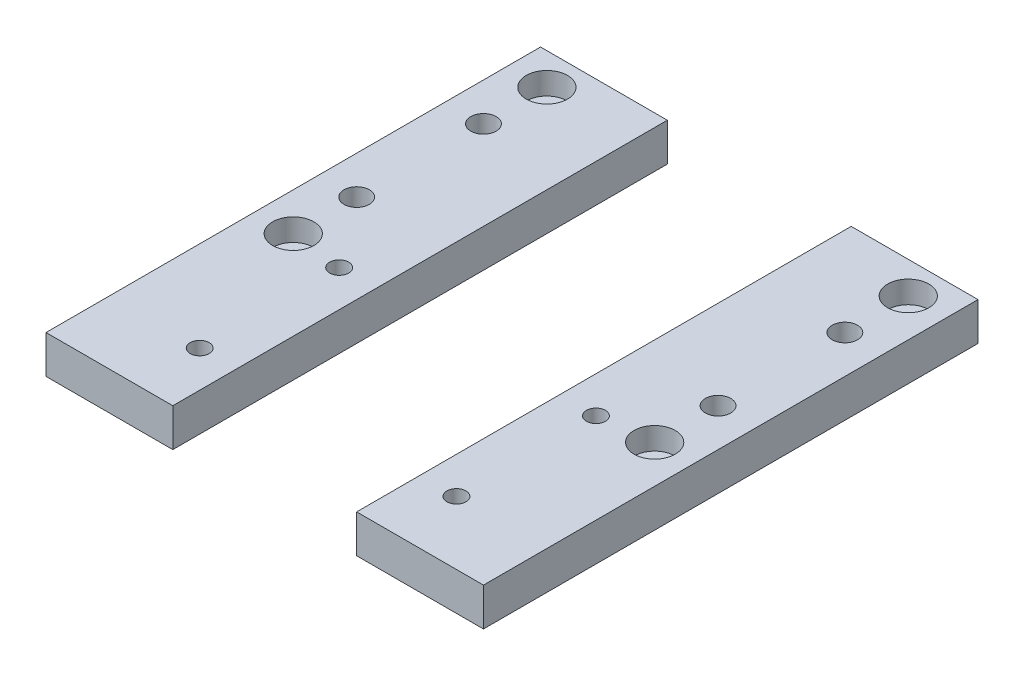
from build123d import *

# Parameters (mm, degrees)
SKETCH_1_W          = 20
SKETCH_1_H          = 6
EXTRUDE_1_DEPTH     = 78
EXTRUDE_1_2_DEPTH   = 78
SKETCH_2_R          = 1.75
SKETCH_2_R_2        = 2
SKETCH_2_R_3        = 1.5
CUT_EXTRUDE_1_DEPTH = 78
SKETCH_3_R          = 3.25
CUT_EXTRUDE_2_DEPTH = 3.5


with BuildPart() as part:
    # Sketch 1 → Extrude 1 (new body)
    with BuildSketch(Plane.XY):
        with Locations((10, 3)):
            Rectangle(SKETCH_1_W, SKETCH_1_H)
    extrude(amount=EXTRUDE_1_DEPTH)


with BuildPart() as body_2:
    # Sketch 1 → Extrude 1 2 (new body)
    with BuildSketch(Plane.XY):
        with Locations((59, 3)):
            Rectangle(SKETCH_1_W, SKETCH_1_H)
    extrude(amount=EXTRUDE_1_2_DEPTH)


with BuildPart() as cut_extrude_1_tool:
    # Sketch 2 → Cut-Extrude 1 (new body)
    with BuildSketch(Plane(origin=(0, 6, 0), x_dir=(1, 0, 0), z_dir=(0, 1, 0))):
        with Locations(Location((6, -5, 0), (0, 0, 270))):
            Circle(SKETCH_2_R)
        with Locations(Location((6, -45, 0), (0, 0, 270))):
            Circle(SKETCH_2_R)
        with Locations(Location((6, -35, 0), (0, 0, 270))):
            Circle(SKETCH_2_R_2)
        with Locations(Location((6, -15, 0), (0, 0, 270))):
            Circle(SKETCH_2_R_2)
        with Locations(Location((14.25, -46.012040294, 0), (0, 0, 270))):
            Circle(SKETCH_2_R_3)
        with Locations(Location((14.25, -68.012040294, 0), (0, 0, 270))):
            Circle(SKETCH_2_R_3)
        with Locations(Location((54.75, -68.012040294, 0), (0, 0, 270))):
            Circle(SKETCH_2_R_3)
        with Locations(Location((54.75, -46.012040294, 0), (0, 0, 270))):
            Circle(SKETCH_2_R_3)
        with Locations(Location((63, -15, 0), (0, 0, 270))):
            Circle(SKETCH_2_R_2)
        with Locations(Location((63, -35, 0), (0, 0, 270))):
            Circle(SKETCH_2_R_2)
        with Locations(Location((63, -45, 0), (0, 0, 270))):
            Circle(SKETCH_2_R)
        with Locations(Location((63, -5, 0), (0, 0, 270))):
            Circle(SKETCH_2_R)
    extrude(amount=-CUT_EXTRUDE_1_DEPTH)


with BuildPart() as part_1:
    add(part.part)

    # Cut-Extrude 1: cut by cut_extrude_1_tool
    add(cut_extrude_1_tool.part, mode=Mode.SUBTRACT)


with BuildPart() as body_2_1:
    add(body_2.part)

    # Cut-Extrude 1: cut by cut_extrude_1_tool
    add(cut_extrude_1_tool.part, mode=Mode.SUBTRACT)


with BuildPart() as cut_extrude_2_tool:
    # Sketch 3 → Cut-Extrude 2 (new body)
    with BuildSketch(Plane(origin=(0, 6, 0), x_dir=(1, 0, 0), z_dir=(0, 1, 0))):
        with Locations(Location((6, -5, 0), (0, 0, 270))):
            Circle(SKETCH_3_R)
        with Locations(Location((6, -45, 0), (0, 0, 270))):
            Circle(SKETCH_3_R)
        with Locations(Location((63, -45, 0), (0, 0, 270))):
            Circle(SKETCH_3_R)
        with Locations(Location((63, -5, 0), (0, 0, 270))):
            Circle(SKETCH_3_R)
    extrude(amount=-CUT_EXTRUDE_2_DEPTH)


with BuildPart() as part_2:
    add(part_1.part)

    # Cut-Extrude 2: cut by cut_extrude_2_tool
    add(cut_extrude_2_tool.part, mode=Mode.SUBTRACT)


with BuildPart() as body_2_2:
    add(body_2_1.part)

    # Cut-Extrude 2: cut by cut_extrude_2_tool
    add(cut_extrude_2_tool.part, mode=Mode.SUBTRACT)


solid = Compound([part_2.part, body_2_2.part])
